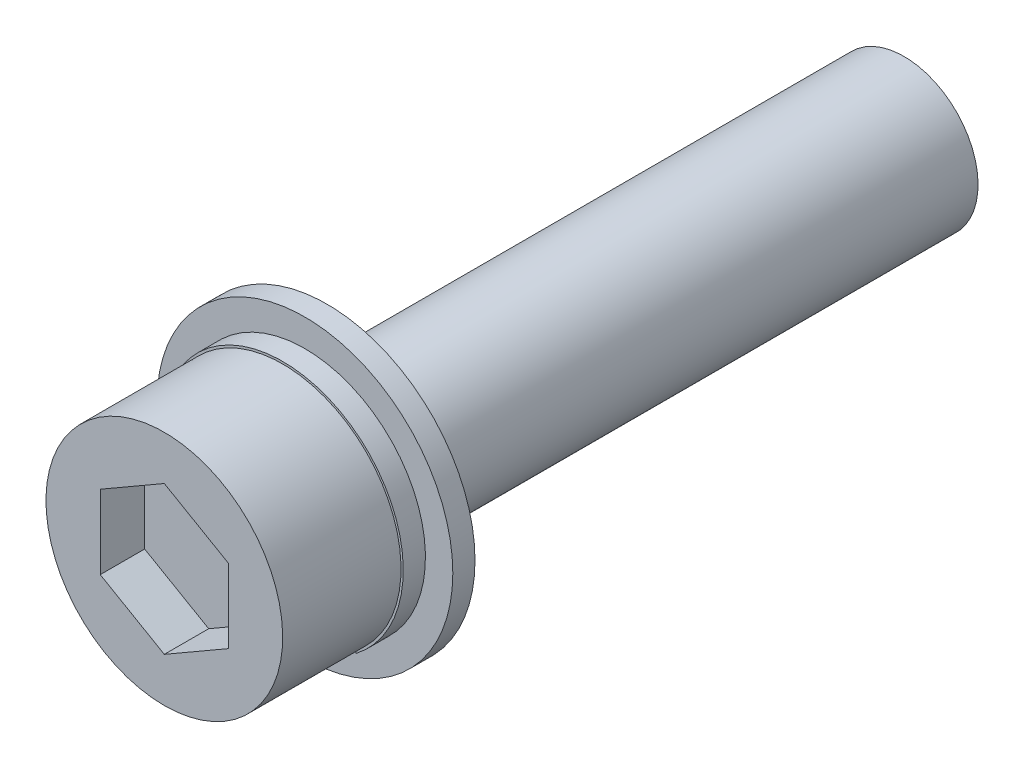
ISO-10303-21;
HEADER;
FILE_DESCRIPTION(('STEP AP214'),'2;1');
FILE_NAME('part.step','',(''),(''),'','','');
FILE_SCHEMA(('AUTOMOTIVE_DESIGN { 1 0 10303 214 1 1 1 1 }'));
ENDSEC;
DATA;
#1=APPLICATION_CONTEXT('core data for automotive mechanical design processes');
#2=APPLICATION_PROTOCOL_DEFINITION('international standard','automotive_design',2000,#1);
#3=PRODUCT_CONTEXT('',#1,'mechanical');
#4=PRODUCT('Part','Part','',(#3));
#5=PRODUCT_RELATED_PRODUCT_CATEGORY('part','',(#4));
#6=PRODUCT_DEFINITION_FORMATION('','',#4);
#7=PRODUCT_DEFINITION_CONTEXT('part definition',#1,'design');
#8=PRODUCT_DEFINITION('design','',#6,#7);
#9=PRODUCT_DEFINITION_SHAPE('','',#8);
#10=(LENGTH_UNIT() NAMED_UNIT(*) SI_UNIT(.MILLI.,.METRE.));
#11=(NAMED_UNIT(*) PLANE_ANGLE_UNIT() SI_UNIT($,.RADIAN.));
#12=(NAMED_UNIT(*) SI_UNIT($,.STERADIAN.) SOLID_ANGLE_UNIT());
#13=UNCERTAINTY_MEASURE_WITH_UNIT(LENGTH_MEASURE(1.E-05),#10,'distance_accuracy_value','');
#14=(GEOMETRIC_REPRESENTATION_CONTEXT(3) GLOBAL_UNCERTAINTY_ASSIGNED_CONTEXT((#13)) GLOBAL_UNIT_ASSIGNED_CONTEXT((#10,
#11,#12)) REPRESENTATION_CONTEXT('',''));
#15=CARTESIAN_POINT('',(0.,0.,0.));
#16=DIRECTION('',(0.,0.,1.));
#17=DIRECTION('',(1.,0.,0.));
#18=AXIS2_PLACEMENT_3D('',#15,#16,#17);
#19=CARTESIAN_POINT('',(0.,8.00000000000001,17.));
#20=DIRECTION('',(0.,0.,1.));
#21=DIRECTION('',(0.,1.,0.));
#22=AXIS2_PLACEMENT_3D('',#19,#20,#21);
#23=PLANE('',#22);
#24=CARTESIAN_POINT('',(0.,0.,17.));
#25=DIRECTION('',(0.,0.,1.));
#26=DIRECTION('',(0.,-1.,0.));
#27=AXIS2_PLACEMENT_3D('',#24,#25,#26);
#28=CIRCLE('',#27,5.);
#29=CARTESIAN_POINT('',(0.,-4.99999999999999,17.));
#30=VERTEX_POINT('',#29);
#31=EDGE_CURVE('E199',#30,#30,#28,.T.);
#32=ORIENTED_EDGE('',*,*,#31,.T.);
#33=EDGE_LOOP('',(#32));
#34=FACE_BOUND('',#33,.T.);
#35=DIRECTION('',(0.610405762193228,-0.792088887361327,0.));
#36=VECTOR('',#35,1.);
#37=CARTESIAN_POINT('',(3.14358967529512,-4.07925776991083,17.));
#38=LINE('',#37,#36);
#39=CARTESIAN_POINT('',(3.14358967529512,-4.07925776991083,17.));
#40=VERTEX_POINT('',#39);
#41=CARTESIAN_POINT('',(4.88324609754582,-6.33671109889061,17.));
#42=VERTEX_POINT('',#41);
#43=EDGE_CURVE('E301',#40,#42,#38,.T.);
#44=ORIENTED_EDGE('',*,*,#43,.T.);
#45=CARTESIAN_POINT('',(0.,0.,17.));
#46=DIRECTION('',(0.,0.,1.));
#47=DIRECTION('',(0.,-1.,0.));
#48=AXIS2_PLACEMENT_3D('',#45,#46,#47);
#49=CIRCLE('',#48,8.);
#50=CARTESIAN_POINT('',(4.19929189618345,-6.80925455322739,17.));
#51=VERTEX_POINT('',#50);
#52=EDGE_CURVE('E203',#51,#42,#49,.T.);
#53=ORIENTED_EDGE('',*,*,#52,.F.);
#54=DIRECTION('',(-0.524911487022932,0.851156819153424,0.));
#55=VECTOR('',#54,1.);
#56=CARTESIAN_POINT('',(-3.57425593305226,5.795743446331,17.));
#57=LINE('',#56,#55);
#58=CARTESIAN_POINT('',(2.7032941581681,-4.38345761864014,17.));
#59=VERTEX_POINT('',#58);
#60=EDGE_CURVE('E11',#51,#59,#57,.T.);
#61=ORIENTED_EDGE('',*,*,#60,.T.);
#62=CARTESIAN_POINT('',(0.,0.,17.));
#63=DIRECTION('',(0.,0.,-1.));
#64=DIRECTION('',(1.,0.,0.));
#65=AXIS2_PLACEMENT_3D('',#62,#63,#64);
#66=CIRCLE('',#65,5.15);
#67=EDGE_CURVE('E143',#59,#40,#66,.T.);
#68=ORIENTED_EDGE('',*,*,#67,.T.);
#69=EDGE_LOOP('',(#44,#53,#61,#68));
#70=FACE_BOUND('',#69,.T.);
#71=ADVANCED_FACE('F37',(#34,#70),#23,.F.);
#72=CARTESIAN_POINT('',(0.,5.,-25.));
#73=DIRECTION('',(0.,0.,1.));
#74=DIRECTION('',(0.,1.,0.));
#75=AXIS2_PLACEMENT_3D('',#72,#73,#74);
#76=PLANE('',#75);
#77=CARTESIAN_POINT('',(0.,0.,-25.));
#78=DIRECTION('',(0.,0.,1.));
#79=DIRECTION('',(0.,-1.,0.));
#80=AXIS2_PLACEMENT_3D('',#77,#78,#79);
#81=CIRCLE('',#80,5.);
#82=CARTESIAN_POINT('',(0.,-5.,-25.));
#83=VERTEX_POINT('',#82);
#84=EDGE_CURVE('E187',#83,#83,#81,.T.);
#85=ORIENTED_EDGE('',*,*,#84,.F.);
#86=EDGE_LOOP('',(#85));
#87=FACE_BOUND('',#86,.T.);
#88=ADVANCED_FACE('F39',(#87),#76,.F.);
#89=CARTESIAN_POINT('',(0.,0.,25.));
#90=DIRECTION('',(0.,0.,-1.));
#91=DIRECTION('',(0.,-1.,0.));
#92=AXIS2_PLACEMENT_3D('',#89,#90,#91);
#93=PLANE('',#92);
#94=DIRECTION('',(0.866025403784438,0.500000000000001,0.));
#95=VECTOR('',#94,1.);
#96=CARTESIAN_POINT('',(0.,5.,25.));
#97=LINE('',#96,#95);
#98=CARTESIAN_POINT('',(-4.3301270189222,2.49999999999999,25.));
#99=VERTEX_POINT('',#98);
#100=CARTESIAN_POINT('',(0.,5.,25.));
#101=VERTEX_POINT('',#100);
#102=EDGE_CURVE('E171',#99,#101,#97,.T.);
#103=ORIENTED_EDGE('',*,*,#102,.T.);
#104=DIRECTION('',(0.866025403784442,-0.499999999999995,0.));
#105=VECTOR('',#104,1.);
#106=CARTESIAN_POINT('',(4.33012701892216,2.50000000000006,25.));
#107=LINE('',#106,#105);
#108=CARTESIAN_POINT('',(4.33012701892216,2.50000000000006,25.));
#109=VERTEX_POINT('',#108);
#110=EDGE_CURVE('E174',#101,#109,#107,.T.);
#111=ORIENTED_EDGE('',*,*,#110,.T.);
#112=DIRECTION('',(0.,-1.,0.));
#113=VECTOR('',#112,1.);
#114=CARTESIAN_POINT('',(4.33012701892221,-2.49999999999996,25.));
#115=LINE('',#114,#113);
#116=CARTESIAN_POINT('',(4.33012701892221,-2.49999999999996,25.));
#117=VERTEX_POINT('',#116);
#118=EDGE_CURVE('E177',#109,#117,#115,.T.);
#119=ORIENTED_EDGE('',*,*,#118,.T.);
#120=DIRECTION('',(-0.866025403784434,-0.500000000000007,0.));
#121=VECTOR('',#120,1.);
#122=CARTESIAN_POINT('',(0.,-5.,25.));
#123=LINE('',#122,#121);
#124=CARTESIAN_POINT('',(0.,-5.,25.));
#125=VERTEX_POINT('',#124);
#126=EDGE_CURVE('E180',#117,#125,#123,.T.);
#127=ORIENTED_EDGE('',*,*,#126,.T.);
#128=DIRECTION('',(-0.866025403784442,0.499999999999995,0.));
#129=VECTOR('',#128,1.);
#130=CARTESIAN_POINT('',(-4.33012701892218,-2.50000000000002,25.));
#131=LINE('',#130,#129);
#132=CARTESIAN_POINT('',(-4.33012701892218,-2.50000000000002,25.));
#133=VERTEX_POINT('',#132);
#134=EDGE_CURVE('E158',#125,#133,#131,.T.);
#135=ORIENTED_EDGE('',*,*,#134,.T.);
#136=DIRECTION('',(0.,1.,0.));
#137=VECTOR('',#136,1.);
#138=CARTESIAN_POINT('',(-4.3301270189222,2.49999999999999,25.));
#139=LINE('',#138,#137);
#140=EDGE_CURVE('E153',#133,#99,#139,.T.);
#141=ORIENTED_EDGE('',*,*,#140,.T.);
#142=EDGE_LOOP('',(#103,#111,#119,#127,#135,#141));
#143=FACE_BOUND('',#142,.T.);
#144=CARTESIAN_POINT('',(0.,0.,25.));
#145=DIRECTION('',(0.,0.,1.));
#146=DIRECTION('',(0.,-1.,0.));
#147=AXIS2_PLACEMENT_3D('',#144,#145,#146);
#148=CIRCLE('',#147,8.);
#149=CARTESIAN_POINT('',(0.,-7.99999999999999,25.));
#150=VERTEX_POINT('',#149);
#151=EDGE_CURVE('E45',#150,#150,#148,.T.);
#152=ORIENTED_EDGE('',*,*,#151,.T.);
#153=EDGE_LOOP('',(#152));
#154=FACE_BOUND('',#153,.T.);
#155=ADVANCED_FACE('F208',(#143,#154),#93,.F.);
#156=CARTESIAN_POINT('',(0.,0.,-25.));
#157=DIRECTION('',(0.,0.,-1.));
#158=DIRECTION('',(0.,-1.,0.));
#159=AXIS2_PLACEMENT_3D('',#156,#157,#158);
#160=CYLINDRICAL_SURFACE('',#159,8.);
#161=ORIENTED_EDGE('',*,*,#52,.T.);
#162=EDGE_CURVE('E202',#42,#51,#49,.T.);
#163=ORIENTED_EDGE('',*,*,#162,.T.);
#164=EDGE_LOOP('',(#161,#163));
#165=FACE_BOUND('',#164,.T.);
#166=ORIENTED_EDGE('',*,*,#151,.F.);
#167=EDGE_LOOP('',(#166));
#168=FACE_BOUND('',#167,.T.);
#169=ADVANCED_FACE('F210',(#165,#168),#160,.T.);
#170=CARTESIAN_POINT('',(0.,0.,-25.));
#171=DIRECTION('',(0.,0.,-1.));
#172=DIRECTION('',(0.,-1.,0.));
#173=AXIS2_PLACEMENT_3D('',#170,#171,#172);
#174=CYLINDRICAL_SURFACE('',#173,5.);
#175=ORIENTED_EDGE('',*,*,#84,.T.);
#176=EDGE_LOOP('',(#175));
#177=FACE_BOUND('',#176,.T.);
#178=ORIENTED_EDGE('',*,*,#31,.F.);
#179=EDGE_LOOP('',(#178));
#180=FACE_BOUND('',#179,.T.);
#181=ADVANCED_FACE('F212',(#177,#180),#174,.T.);
#182=CARTESIAN_POINT('',(-4.3301270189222,2.49999999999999,22.));
#183=DIRECTION('',(-1.,0.,0.));
#184=DIRECTION('',(0.,-1.,0.));
#185=AXIS2_PLACEMENT_3D('',#182,#183,#184);
#186=PLANE('',#185);
#187=ORIENTED_EDGE('',*,*,#140,.F.);
#188=DIRECTION('',(0.,0.,1.));
#189=VECTOR('',#188,1.);
#190=CARTESIAN_POINT('',(-4.33012701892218,-2.50000000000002,22.));
#191=LINE('',#190,#189);
#192=CARTESIAN_POINT('',(-4.33012701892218,-2.50000000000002,22.));
#193=VERTEX_POINT('',#192);
#194=EDGE_CURVE('E185',#193,#133,#191,.T.);
#195=ORIENTED_EDGE('',*,*,#194,.F.);
#196=DIRECTION('',(0.,1.,0.));
#197=VECTOR('',#196,1.);
#198=CARTESIAN_POINT('',(-4.3301270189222,2.49999999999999,22.));
#199=LINE('',#198,#197);
#200=CARTESIAN_POINT('',(-4.3301270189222,2.49999999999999,22.));
#201=VERTEX_POINT('',#200);
#202=EDGE_CURVE('E154',#193,#201,#199,.T.);
#203=ORIENTED_EDGE('',*,*,#202,.T.);
#204=DIRECTION('',(0.,0.,1.));
#205=VECTOR('',#204,1.);
#206=CARTESIAN_POINT('',(-4.3301270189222,2.49999999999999,22.));
#207=LINE('',#206,#205);
#208=EDGE_CURVE('E168',#201,#99,#207,.T.);
#209=ORIENTED_EDGE('',*,*,#208,.T.);
#210=EDGE_LOOP('',(#187,#195,#203,#209));
#211=FACE_BOUND('',#210,.T.);
#212=ADVANCED_FACE('F219',(#211),#186,.F.);
#213=CARTESIAN_POINT('',(-4.33012701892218,-2.50000000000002,22.));
#214=DIRECTION('',(-0.499999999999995,-0.866025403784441,0.));
#215=DIRECTION('',(0.866025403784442,-0.499999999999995,0.));
#216=AXIS2_PLACEMENT_3D('',#213,#214,#215);
#217=PLANE('',#216);
#218=ORIENTED_EDGE('',*,*,#134,.F.);
#219=DIRECTION('',(0.,0.,1.));
#220=VECTOR('',#219,1.);
#221=CARTESIAN_POINT('',(0.,-5.,22.));
#222=LINE('',#221,#220);
#223=CARTESIAN_POINT('',(0.,-5.,22.));
#224=VERTEX_POINT('',#223);
#225=EDGE_CURVE('E188',#224,#125,#222,.T.);
#226=ORIENTED_EDGE('',*,*,#225,.F.);
#227=DIRECTION('',(-0.866025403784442,0.499999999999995,0.));
#228=VECTOR('',#227,1.);
#229=CARTESIAN_POINT('',(-4.33012701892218,-2.50000000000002,22.));
#230=LINE('',#229,#228);
#231=EDGE_CURVE('E166',#224,#193,#230,.T.);
#232=ORIENTED_EDGE('',*,*,#231,.T.);
#233=ORIENTED_EDGE('',*,*,#194,.T.);
#234=EDGE_LOOP('',(#218,#226,#232,#233));
#235=FACE_BOUND('',#234,.T.);
#236=ADVANCED_FACE('F234',(#235),#217,.F.);
#237=CARTESIAN_POINT('',(0.,-5.,22.));
#238=DIRECTION('',(0.500000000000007,-0.866025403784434,0.));
#239=DIRECTION('',(0.866025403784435,0.500000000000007,0.));
#240=AXIS2_PLACEMENT_3D('',#237,#238,#239);
#241=PLANE('',#240);
#242=ORIENTED_EDGE('',*,*,#126,.F.);
#243=DIRECTION('',(0.,0.,1.));
#244=VECTOR('',#243,1.);
#245=CARTESIAN_POINT('',(4.33012701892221,-2.49999999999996,22.));
#246=LINE('',#245,#244);
#247=CARTESIAN_POINT('',(4.33012701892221,-2.49999999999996,22.));
#248=VERTEX_POINT('',#247);
#249=EDGE_CURVE('E190',#248,#117,#246,.T.);
#250=ORIENTED_EDGE('',*,*,#249,.F.);
#251=DIRECTION('',(-0.866025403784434,-0.500000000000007,0.));
#252=VECTOR('',#251,1.);
#253=CARTESIAN_POINT('',(0.,-5.,22.));
#254=LINE('',#253,#252);
#255=EDGE_CURVE('E164',#248,#224,#254,.T.);
#256=ORIENTED_EDGE('',*,*,#255,.T.);
#257=ORIENTED_EDGE('',*,*,#225,.T.);
#258=EDGE_LOOP('',(#242,#250,#256,#257));
#259=FACE_BOUND('',#258,.T.);
#260=ADVANCED_FACE('F248',(#259),#241,.F.);
#261=CARTESIAN_POINT('',(4.33012701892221,-2.49999999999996,22.));
#262=DIRECTION('',(1.,0.,0.));
#263=DIRECTION('',(0.,1.,0.));
#264=AXIS2_PLACEMENT_3D('',#261,#262,#263);
#265=PLANE('',#264);
#266=ORIENTED_EDGE('',*,*,#118,.F.);
#267=DIRECTION('',(0.,0.,1.));
#268=VECTOR('',#267,1.);
#269=CARTESIAN_POINT('',(4.33012701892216,2.50000000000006,22.));
#270=LINE('',#269,#268);
#271=CARTESIAN_POINT('',(4.33012701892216,2.50000000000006,22.));
#272=VERTEX_POINT('',#271);
#273=EDGE_CURVE('E192',#272,#109,#270,.T.);
#274=ORIENTED_EDGE('',*,*,#273,.F.);
#275=DIRECTION('',(0.,-1.,0.));
#276=VECTOR('',#275,1.);
#277=CARTESIAN_POINT('',(4.33012701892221,-2.49999999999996,22.));
#278=LINE('',#277,#276);
#279=EDGE_CURVE('E162',#272,#248,#278,.T.);
#280=ORIENTED_EDGE('',*,*,#279,.T.);
#281=ORIENTED_EDGE('',*,*,#249,.T.);
#282=EDGE_LOOP('',(#266,#274,#280,#281));
#283=FACE_BOUND('',#282,.T.);
#284=ADVANCED_FACE('F244',(#283),#265,.F.);
#285=CARTESIAN_POINT('',(4.33012701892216,2.50000000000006,22.));
#286=DIRECTION('',(0.499999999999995,0.866025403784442,0.));
#287=DIRECTION('',(-0.866025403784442,0.499999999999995,0.));
#288=AXIS2_PLACEMENT_3D('',#285,#286,#287);
#289=PLANE('',#288);
#290=ORIENTED_EDGE('',*,*,#110,.F.);
#291=DIRECTION('',(0.,0.,1.));
#292=VECTOR('',#291,1.);
#293=CARTESIAN_POINT('',(0.,5.,22.));
#294=LINE('',#293,#292);
#295=CARTESIAN_POINT('',(0.,5.,22.));
#296=VERTEX_POINT('',#295);
#297=EDGE_CURVE('E194',#296,#101,#294,.T.);
#298=ORIENTED_EDGE('',*,*,#297,.F.);
#299=DIRECTION('',(0.866025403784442,-0.499999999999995,0.));
#300=VECTOR('',#299,1.);
#301=CARTESIAN_POINT('',(4.33012701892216,2.50000000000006,22.));
#302=LINE('',#301,#300);
#303=EDGE_CURVE('E160',#296,#272,#302,.T.);
#304=ORIENTED_EDGE('',*,*,#303,.T.);
#305=ORIENTED_EDGE('',*,*,#273,.T.);
#306=EDGE_LOOP('',(#290,#298,#304,#305));
#307=FACE_BOUND('',#306,.T.);
#308=ADVANCED_FACE('F240',(#307),#289,.F.);
#309=CARTESIAN_POINT('',(0.,5.,22.));
#310=DIRECTION('',(-0.500000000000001,0.866025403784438,0.));
#311=DIRECTION('',(-0.866025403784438,-0.500000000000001,0.));
#312=AXIS2_PLACEMENT_3D('',#309,#310,#311);
#313=PLANE('',#312);
#314=ORIENTED_EDGE('',*,*,#102,.F.);
#315=ORIENTED_EDGE('',*,*,#208,.F.);
#316=DIRECTION('',(0.866025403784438,0.500000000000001,0.));
#317=VECTOR('',#316,1.);
#318=CARTESIAN_POINT('',(0.,5.,22.));
#319=LINE('',#318,#317);
#320=EDGE_CURVE('E157',#201,#296,#319,.T.);
#321=ORIENTED_EDGE('',*,*,#320,.T.);
#322=ORIENTED_EDGE('',*,*,#297,.T.);
#323=EDGE_LOOP('',(#314,#315,#321,#322));
#324=FACE_BOUND('',#323,.T.);
#325=ADVANCED_FACE('F236',(#324),#313,.F.);
#326=CARTESIAN_POINT('',(0.,0.,22.));
#327=DIRECTION('',(0.,0.,-1.));
#328=DIRECTION('',(1.,0.,0.));
#329=AXIS2_PLACEMENT_3D('',#326,#327,#328);
#330=PLANE('',#329);
#331=ORIENTED_EDGE('',*,*,#202,.F.);
#332=ORIENTED_EDGE('',*,*,#231,.F.);
#333=ORIENTED_EDGE('',*,*,#255,.F.);
#334=ORIENTED_EDGE('',*,*,#279,.F.);
#335=ORIENTED_EDGE('',*,*,#303,.F.);
#336=ORIENTED_EDGE('',*,*,#320,.F.);
#337=EDGE_LOOP('',(#331,#332,#333,#334,#335,#336));
#338=FACE_BOUND('',#337,.T.);
#339=ADVANCED_FACE('F239',(#338),#330,.F.);
#340=CARTESIAN_POINT('',(0.,0.,15.5));
#341=DIRECTION('',(0.,0.,1.));
#342=DIRECTION('',(-1.,0.,0.));
#343=AXIS2_PLACEMENT_3D('',#340,#341,#342);
#344=CYLINDRICAL_SURFACE('',#343,5.15);
#345=ORIENTED_EDGE('',*,*,#67,.F.);
#346=DIRECTION('',(0.,0.,1.));
#347=VECTOR('',#346,1.);
#348=CARTESIAN_POINT('',(2.7032941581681,-4.38345761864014,15.5));
#349=LINE('',#348,#347);
#350=CARTESIAN_POINT('',(2.7032941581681,-4.38345761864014,15.5));
#351=VERTEX_POINT('',#350);
#352=EDGE_CURVE('E128',#351,#59,#349,.T.);
#353=ORIENTED_EDGE('',*,*,#352,.F.);
#354=CARTESIAN_POINT('',(0.,0.,15.5));
#355=DIRECTION('',(0.,0.,1.));
#356=DIRECTION('',(1.,0.,0.));
#357=AXIS2_PLACEMENT_3D('',#354,#355,#356);
#358=CIRCLE('',#357,5.15);
#359=CARTESIAN_POINT('',(3.14358967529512,-4.07925776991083,15.5));
#360=VERTEX_POINT('',#359);
#361=EDGE_CURVE('E135',#351,#360,#358,.T.);
#362=ORIENTED_EDGE('',*,*,#361,.T.);
#363=DIRECTION('',(0.,0.,1.));
#364=VECTOR('',#363,1.);
#365=CARTESIAN_POINT('',(3.14358967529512,-4.07925776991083,15.5));
#366=LINE('',#365,#364);
#367=EDGE_CURVE('E52',#360,#40,#366,.T.);
#368=ORIENTED_EDGE('',*,*,#367,.T.);
#369=EDGE_LOOP('',(#345,#353,#362,#368));
#370=FACE_BOUND('',#369,.T.);
#371=CARTESIAN_POINT('',(0.,0.,14.));
#372=DIRECTION('',(0.,0.,1.));
#373=DIRECTION('',(1.,0.,0.));
#374=AXIS2_PLACEMENT_3D('',#371,#372,#373);
#375=CIRCLE('',#374,5.15);
#376=CARTESIAN_POINT('',(5.15,0.,14.));
#377=VERTEX_POINT('',#376);
#378=EDGE_CURVE('E139',#377,#377,#375,.T.);
#379=ORIENTED_EDGE('',*,*,#378,.F.);
#380=EDGE_LOOP('',(#379));
#381=FACE_BOUND('',#380,.T.);
#382=ADVANCED_FACE('F141',(#370,#381),#344,.F.);
#383=CARTESIAN_POINT('',(3.14358967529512,-4.07925776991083,15.5));
#384=DIRECTION('',(0.792088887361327,0.610405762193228,0.));
#385=DIRECTION('',(-0.610405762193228,0.792088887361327,0.));
#386=AXIS2_PLACEMENT_3D('',#383,#384,#385);
#387=PLANE('',#386);
#388=ORIENTED_EDGE('',*,*,#43,.F.);
#389=ORIENTED_EDGE('',*,*,#367,.F.);
#390=DIRECTION('',(0.610405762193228,-0.792088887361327,0.));
#391=VECTOR('',#390,1.);
#392=CARTESIAN_POINT('',(3.14358967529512,-4.07925776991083,15.5));
#393=LINE('',#392,#391);
#394=CARTESIAN_POINT('',(4.97480696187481,-6.45552443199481,15.5));
#395=VERTEX_POINT('',#394);
#396=EDGE_CURVE('E138',#360,#395,#393,.T.);
#397=ORIENTED_EDGE('',*,*,#396,.T.);
#398=DIRECTION('',(0.,0.,1.));
#399=VECTOR('',#398,1.);
#400=CARTESIAN_POINT('',(4.97480696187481,-6.45552443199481,15.5));
#401=LINE('',#400,#399);
#402=CARTESIAN_POINT('',(4.97480696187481,-6.45552443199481,17.));
#403=VERTEX_POINT('',#402);
#404=EDGE_CURVE('E145',#395,#403,#401,.T.);
#405=ORIENTED_EDGE('',*,*,#404,.T.);
#406=EDGE_CURVE('E60',#42,#403,#38,.T.);
#407=ORIENTED_EDGE('',*,*,#406,.F.);
#408=EDGE_LOOP('',(#388,#389,#397,#405,#407));
#409=FACE_BOUND('',#408,.T.);
#410=ADVANCED_FACE('F261',(#409),#387,.F.);
#411=CARTESIAN_POINT('',(0.,0.,15.5));
#412=DIRECTION('',(0.,0.,1.));
#413=DIRECTION('',(-1.,0.,0.));
#414=AXIS2_PLACEMENT_3D('',#411,#412,#413);
#415=CYLINDRICAL_SURFACE('',#414,8.15);
#416=CARTESIAN_POINT('',(0.,0.,17.));
#417=DIRECTION('',(0.,0.,1.));
#418=DIRECTION('',(1.,0.,0.));
#419=AXIS2_PLACEMENT_3D('',#416,#417,#418);
#420=CIRCLE('',#419,8.15);
#421=CARTESIAN_POINT('',(4.27802861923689,-6.93692807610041,17.));
#422=VERTEX_POINT('',#421);
#423=EDGE_CURVE('E303',#403,#422,#420,.T.);
#424=ORIENTED_EDGE('',*,*,#423,.F.);
#425=ORIENTED_EDGE('',*,*,#404,.F.);
#426=CARTESIAN_POINT('',(0.,0.,15.5));
#427=DIRECTION('',(0.,0.,1.));
#428=DIRECTION('',(1.,0.,0.));
#429=AXIS2_PLACEMENT_3D('',#426,#427,#428);
#430=CIRCLE('',#429,8.15);
#431=CARTESIAN_POINT('',(4.27802861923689,-6.93692807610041,15.5));
#432=VERTEX_POINT('',#431);
#433=EDGE_CURVE('E133',#395,#432,#430,.T.);
#434=ORIENTED_EDGE('',*,*,#433,.T.);
#435=DIRECTION('',(0.,0.,1.));
#436=VECTOR('',#435,1.);
#437=CARTESIAN_POINT('',(4.27802861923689,-6.93692807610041,15.5));
#438=LINE('',#437,#436);
#439=EDGE_CURVE('E130',#432,#422,#438,.T.);
#440=ORIENTED_EDGE('',*,*,#439,.T.);
#441=EDGE_LOOP('',(#424,#425,#434,#440));
#442=FACE_BOUND('',#441,.T.);
#443=ADVANCED_FACE('F264',(#442),#415,.T.);
#444=CARTESIAN_POINT('',(2.7032941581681,-4.38345761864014,15.5));
#445=DIRECTION('',(-0.851156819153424,-0.524911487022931,0.));
#446=DIRECTION('',(0.524911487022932,-0.851156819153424,0.));
#447=AXIS2_PLACEMENT_3D('',#444,#445,#446);
#448=PLANE('',#447);
#449=DIRECTION('',(-0.524911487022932,0.851156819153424,0.));
#450=VECTOR('',#449,1.);
#451=CARTESIAN_POINT('',(2.7032941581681,-4.38345761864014,17.));
#452=LINE('',#451,#450);
#453=EDGE_CURVE('E148',#422,#51,#452,.T.);
#454=ORIENTED_EDGE('',*,*,#453,.F.);
#455=ORIENTED_EDGE('',*,*,#439,.F.);
#456=DIRECTION('',(-0.524911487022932,0.851156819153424,0.));
#457=VECTOR('',#456,1.);
#458=CARTESIAN_POINT('',(2.7032941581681,-4.38345761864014,15.5));
#459=LINE('',#458,#457);
#460=EDGE_CURVE('E123',#432,#351,#459,.T.);
#461=ORIENTED_EDGE('',*,*,#460,.T.);
#462=ORIENTED_EDGE('',*,*,#352,.T.);
#463=ORIENTED_EDGE('',*,*,#60,.F.);
#464=EDGE_LOOP('',(#454,#455,#461,#462,#463));
#465=FACE_BOUND('',#464,.T.);
#466=ADVANCED_FACE('F125',(#465),#448,.F.);
#467=CARTESIAN_POINT('',(0.,0.,17.));
#468=DIRECTION('',(0.,0.,-1.));
#469=DIRECTION('',(1.,0.,0.));
#470=AXIS2_PLACEMENT_3D('',#467,#468,#469);
#471=PLANE('',#470);
#472=ORIENTED_EDGE('',*,*,#406,.T.);
#473=ORIENTED_EDGE('',*,*,#423,.T.);
#474=ORIENTED_EDGE('',*,*,#453,.T.);
#475=ORIENTED_EDGE('',*,*,#162,.F.);
#476=EDGE_LOOP('',(#472,#473,#474,#475));
#477=FACE_BOUND('',#476,.T.);
#478=ADVANCED_FACE('F270',(#477),#471,.F.);
#479=CARTESIAN_POINT('',(0.,0.,15.5));
#480=DIRECTION('',(0.,0.,-1.));
#481=DIRECTION('',(1.,0.,0.));
#482=AXIS2_PLACEMENT_3D('',#479,#480,#481);
#483=PLANE('',#482);
#484=CARTESIAN_POINT('',(0.,0.,15.5));
#485=DIRECTION('',(0.,0.,1.));
#486=DIRECTION('',(1.,0.,0.));
#487=AXIS2_PLACEMENT_3D('',#484,#485,#486);
#488=CIRCLE('',#487,10.);
#489=CARTESIAN_POINT('',(10.,0.,15.5));
#490=VERTEX_POINT('',#489);
#491=EDGE_CURVE('E292',#490,#490,#488,.T.);
#492=ORIENTED_EDGE('',*,*,#491,.T.);
#493=EDGE_LOOP('',(#492));
#494=FACE_BOUND('',#493,.T.);
#495=ORIENTED_EDGE('',*,*,#361,.F.);
#496=ORIENTED_EDGE('',*,*,#460,.F.);
#497=ORIENTED_EDGE('',*,*,#433,.F.);
#498=ORIENTED_EDGE('',*,*,#396,.F.);
#499=EDGE_LOOP('',(#495,#496,#497,#498));
#500=FACE_BOUND('',#499,.T.);
#501=ADVANCED_FACE('F136',(#494,#500),#483,.F.);
#502=CARTESIAN_POINT('',(0.,0.,14.));
#503=DIRECTION('',(0.,0.,-1.));
#504=DIRECTION('',(1.,0.,0.));
#505=AXIS2_PLACEMENT_3D('',#502,#503,#504);
#506=PLANE('',#505);
#507=CARTESIAN_POINT('',(0.,0.,14.));
#508=DIRECTION('',(0.,0.,1.));
#509=DIRECTION('',(1.,0.,0.));
#510=AXIS2_PLACEMENT_3D('',#507,#508,#509);
#511=CIRCLE('',#510,10.);
#512=CARTESIAN_POINT('',(10.,0.,14.));
#513=VERTEX_POINT('',#512);
#514=EDGE_CURVE('E289',#513,#513,#511,.T.);
#515=ORIENTED_EDGE('',*,*,#514,.F.);
#516=EDGE_LOOP('',(#515));
#517=FACE_BOUND('',#516,.T.);
#518=ORIENTED_EDGE('',*,*,#378,.T.);
#519=EDGE_LOOP('',(#518));
#520=FACE_BOUND('',#519,.T.);
#521=ADVANCED_FACE('F277',(#517,#520),#506,.T.);
#522=CARTESIAN_POINT('',(0.,0.,14.));
#523=DIRECTION('',(0.,0.,1.));
#524=DIRECTION('',(-1.,0.,0.));
#525=AXIS2_PLACEMENT_3D('',#522,#523,#524);
#526=CYLINDRICAL_SURFACE('',#525,10.);
#527=ORIENTED_EDGE('',*,*,#514,.T.);
#528=EDGE_LOOP('',(#527));
#529=FACE_BOUND('',#528,.T.);
#530=ORIENTED_EDGE('',*,*,#491,.F.);
#531=EDGE_LOOP('',(#530));
#532=FACE_BOUND('',#531,.T.);
#533=ADVANCED_FACE('F274',(#529,#532),#526,.T.);
#534=CLOSED_SHELL('',(#71,#88,#155,#169,#181,#212,#236,#260,#284,#308,#325,#339,#382,#410,#443,
#466,#478,#501,#521,#533));
#535=MANIFOLD_SOLID_BREP('B2',#534);
#536=ADVANCED_BREP_SHAPE_REPRESENTATION('',(#18,#535),#14);
#537=SHAPE_DEFINITION_REPRESENTATION(#9,#536);
ENDSEC;
END-ISO-10303-21;
